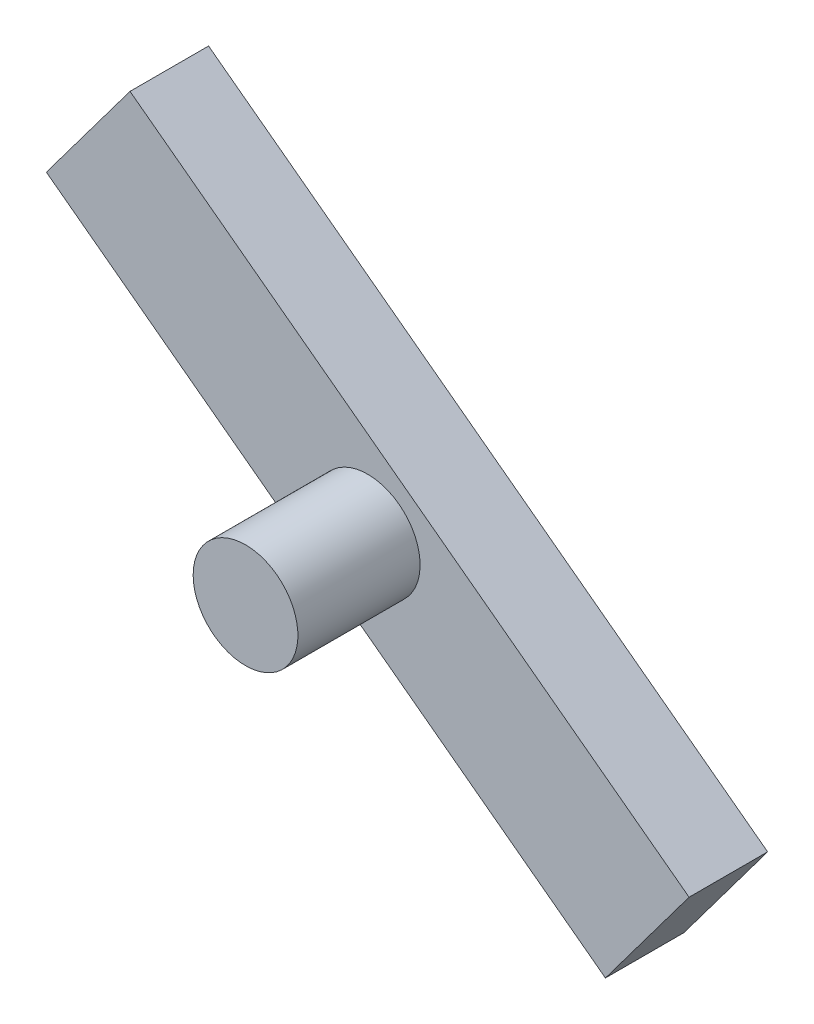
ISO-10303-21;
HEADER;
FILE_DESCRIPTION(('STEP AP214'),'2;1');
FILE_NAME('part.step','',(''),(''),'','','');
FILE_SCHEMA(('AUTOMOTIVE_DESIGN { 1 0 10303 214 1 1 1 1 }'));
ENDSEC;
DATA;
#1=APPLICATION_CONTEXT('core data for automotive mechanical design processes');
#2=APPLICATION_PROTOCOL_DEFINITION('international standard','automotive_design',2000,#1);
#3=PRODUCT_CONTEXT('',#1,'mechanical');
#4=PRODUCT('Part','Part','',(#3));
#5=PRODUCT_RELATED_PRODUCT_CATEGORY('part','',(#4));
#6=PRODUCT_DEFINITION_FORMATION('','',#4);
#7=PRODUCT_DEFINITION_CONTEXT('part definition',#1,'design');
#8=PRODUCT_DEFINITION('design','',#6,#7);
#9=PRODUCT_DEFINITION_SHAPE('','',#8);
#10=(LENGTH_UNIT() NAMED_UNIT(*) SI_UNIT(.MILLI.,.METRE.));
#11=(NAMED_UNIT(*) PLANE_ANGLE_UNIT() SI_UNIT($,.RADIAN.));
#12=(NAMED_UNIT(*) SI_UNIT($,.STERADIAN.) SOLID_ANGLE_UNIT());
#13=UNCERTAINTY_MEASURE_WITH_UNIT(LENGTH_MEASURE(1.E-05),#10,'distance_accuracy_value','');
#14=(GEOMETRIC_REPRESENTATION_CONTEXT(3) GLOBAL_UNCERTAINTY_ASSIGNED_CONTEXT((#13)) GLOBAL_UNIT_ASSIGNED_CONTEXT((#10,
#11,#12)) REPRESENTATION_CONTEXT('',''));
#15=CARTESIAN_POINT('',(0.,0.,0.));
#16=DIRECTION('',(0.,0.,1.));
#17=DIRECTION('',(1.,0.,0.));
#18=AXIS2_PLACEMENT_3D('',#15,#16,#17);
#19=CARTESIAN_POINT('',(-263.128358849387,316.504901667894,22.));
#20=DIRECTION('',(0.,0.,-1.));
#21=DIRECTION('',(-1.,0.,0.));
#22=AXIS2_PLACEMENT_3D('',#19,#20,#21);
#23=PLANE('',#22);
#24=CARTESIAN_POINT('',(-263.128358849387,316.504901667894,22.));
#25=DIRECTION('',(0.,0.,-1.));
#26=DIRECTION('',(-1.,0.,0.));
#27=AXIS2_PLACEMENT_3D('',#24,#25,#26);
#28=CIRCLE('',#27,3.);
#29=CARTESIAN_POINT('',(-266.128358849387,316.504901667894,22.));
#30=VERTEX_POINT('',#29);
#31=EDGE_CURVE('E48',#30,#30,#28,.T.);
#32=ORIENTED_EDGE('',*,*,#31,.F.);
#33=EDGE_LOOP('',(#32));
#34=FACE_BOUND('',#33,.T.);
#35=ADVANCED_FACE('F40',(#34),#23,.F.);
#36=CARTESIAN_POINT('',(-263.128358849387,316.504901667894,22.));
#37=DIRECTION('',(0.,0.,-1.));
#38=DIRECTION('',(-1.,0.,0.));
#39=AXIS2_PLACEMENT_3D('',#36,#37,#38);
#40=CYLINDRICAL_SURFACE('',#39,3.);
#41=CARTESIAN_POINT('',(-263.128358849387,316.504901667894,15.));
#42=DIRECTION('',(0.,0.,-1.));
#43=DIRECTION('',(-1.,0.,0.));
#44=AXIS2_PLACEMENT_3D('',#41,#42,#43);
#45=CIRCLE('',#44,3.);
#46=CARTESIAN_POINT('',(-266.128358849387,316.504901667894,15.));
#47=VERTEX_POINT('',#46);
#48=EDGE_CURVE('E12',#47,#47,#45,.T.);
#49=ORIENTED_EDGE('',*,*,#48,.F.);
#50=EDGE_LOOP('',(#49));
#51=FACE_BOUND('',#50,.T.);
#52=ORIENTED_EDGE('',*,*,#31,.T.);
#53=EDGE_LOOP('',(#52));
#54=FACE_BOUND('',#53,.T.);
#55=ADVANCED_FACE('F118',(#51,#54),#40,.T.);
#56=CARTESIAN_POINT('',(-281.537950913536,325.28481738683,15.));
#57=DIRECTION('',(0.599126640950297,0.800654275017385,0.));
#58=DIRECTION('',(-0.800654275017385,0.599126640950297,0.));
#59=AXIS2_PLACEMENT_3D('',#56,#57,#58);
#60=PLANE('',#59);
#61=DIRECTION('',(0.800654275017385,-0.599126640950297,0.));
#62=VECTOR('',#61,1.);
#63=CARTESIAN_POINT('',(-281.537950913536,325.28481738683,10.5));
#64=LINE('',#63,#62);
#65=CARTESIAN_POINT('',(-281.537950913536,325.28481738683,10.5));
#66=VERTEX_POINT('',#65);
#67=CARTESIAN_POINT('',(-249.51177991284,301.319751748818,10.5));
#68=VERTEX_POINT('',#67);
#69=EDGE_CURVE('E107',#66,#68,#64,.T.);
#70=ORIENTED_EDGE('',*,*,#69,.T.);
#71=DIRECTION('',(0.,0.,-1.));
#72=VECTOR('',#71,1.);
#73=CARTESIAN_POINT('',(-249.51177991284,301.319751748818,15.));
#74=LINE('',#73,#72);
#75=CARTESIAN_POINT('',(-249.51177991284,301.319751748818,15.));
#76=VERTEX_POINT('',#75);
#77=EDGE_CURVE('E98',#76,#68,#74,.T.);
#78=ORIENTED_EDGE('',*,*,#77,.F.);
#79=DIRECTION('',(0.800654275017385,-0.599126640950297,0.));
#80=VECTOR('',#79,1.);
#81=CARTESIAN_POINT('',(-281.537950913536,325.28481738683,15.));
#82=LINE('',#81,#80);
#83=CARTESIAN_POINT('',(-281.537950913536,325.28481738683,15.));
#84=VERTEX_POINT('',#83);
#85=EDGE_CURVE('E92',#84,#76,#82,.T.);
#86=ORIENTED_EDGE('',*,*,#85,.F.);
#87=DIRECTION('',(0.,0.,-1.));
#88=VECTOR('',#87,1.);
#89=CARTESIAN_POINT('',(-281.537950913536,325.28481738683,15.));
#90=LINE('',#89,#88);
#91=EDGE_CURVE('E103',#84,#66,#90,.T.);
#92=ORIENTED_EDGE('',*,*,#91,.T.);
#93=EDGE_LOOP('',(#70,#78,#86,#92));
#94=FACE_BOUND('',#93,.T.);
#95=ADVANCED_FACE('F121',(#94),#60,.F.);
#96=CARTESIAN_POINT('',(-249.51177991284,301.319751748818,15.));
#97=DIRECTION('',(-0.800654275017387,0.599126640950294,0.));
#98=DIRECTION('',(-0.599126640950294,-0.800654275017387,0.));
#99=AXIS2_PLACEMENT_3D('',#96,#97,#98);
#100=PLANE('',#99);
#101=DIRECTION('',(0.599126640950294,0.800654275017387,0.));
#102=VECTOR('',#101,1.);
#103=CARTESIAN_POINT('',(-249.51177991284,301.319751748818,10.5));
#104=LINE('',#103,#102);
#105=CARTESIAN_POINT('',(-244.718766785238,307.724985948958,10.5));
#106=VERTEX_POINT('',#105);
#107=EDGE_CURVE('E97',#68,#106,#104,.T.);
#108=ORIENTED_EDGE('',*,*,#107,.T.);
#109=DIRECTION('',(0.,0.,-1.));
#110=VECTOR('',#109,1.);
#111=CARTESIAN_POINT('',(-244.718766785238,307.724985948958,15.));
#112=LINE('',#111,#110);
#113=CARTESIAN_POINT('',(-244.718766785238,307.724985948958,15.));
#114=VERTEX_POINT('',#113);
#115=EDGE_CURVE('E95',#114,#106,#112,.T.);
#116=ORIENTED_EDGE('',*,*,#115,.F.);
#117=DIRECTION('',(0.599126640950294,0.800654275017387,0.));
#118=VECTOR('',#117,1.);
#119=CARTESIAN_POINT('',(-249.51177991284,301.319751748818,15.));
#120=LINE('',#119,#118);
#121=EDGE_CURVE('E87',#76,#114,#120,.T.);
#122=ORIENTED_EDGE('',*,*,#121,.F.);
#123=ORIENTED_EDGE('',*,*,#77,.T.);
#124=EDGE_LOOP('',(#108,#116,#122,#123));
#125=FACE_BOUND('',#124,.T.);
#126=ADVANCED_FACE('F96',(#125),#100,.F.);
#127=CARTESIAN_POINT('',(-244.718766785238,307.724985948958,15.));
#128=DIRECTION('',(-0.599126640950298,-0.800654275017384,0.));
#129=DIRECTION('',(0.800654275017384,-0.599126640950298,0.));
#130=AXIS2_PLACEMENT_3D('',#127,#128,#129);
#131=PLANE('',#130);
#132=DIRECTION('',(-0.800654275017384,0.599126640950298,0.));
#133=VECTOR('',#132,1.);
#134=CARTESIAN_POINT('',(-244.718766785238,307.724985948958,10.5));
#135=LINE('',#134,#133);
#136=CARTESIAN_POINT('',(-276.744937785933,331.690051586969,10.5));
#137=VERTEX_POINT('',#136);
#138=EDGE_CURVE('E73',#106,#137,#135,.T.);
#139=ORIENTED_EDGE('',*,*,#138,.T.);
#140=DIRECTION('',(0.,0.,-1.));
#141=VECTOR('',#140,1.);
#142=CARTESIAN_POINT('',(-276.744937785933,331.690051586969,15.));
#143=LINE('',#142,#141);
#144=CARTESIAN_POINT('',(-276.744937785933,331.690051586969,15.));
#145=VERTEX_POINT('',#144);
#146=EDGE_CURVE('E99',#145,#137,#143,.T.);
#147=ORIENTED_EDGE('',*,*,#146,.F.);
#148=DIRECTION('',(-0.800654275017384,0.599126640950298,0.));
#149=VECTOR('',#148,1.);
#150=CARTESIAN_POINT('',(-244.718766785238,307.724985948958,15.));
#151=LINE('',#150,#149);
#152=EDGE_CURVE('E90',#114,#145,#151,.T.);
#153=ORIENTED_EDGE('',*,*,#152,.F.);
#154=ORIENTED_EDGE('',*,*,#115,.T.);
#155=EDGE_LOOP('',(#139,#147,#153,#154));
#156=FACE_BOUND('',#155,.T.);
#157=ADVANCED_FACE('F101',(#156),#131,.F.);
#158=CARTESIAN_POINT('',(-276.744937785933,331.690051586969,15.));
#159=DIRECTION('',(0.800654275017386,-0.599126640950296,0.));
#160=DIRECTION('',(0.599126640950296,0.800654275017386,0.));
#161=AXIS2_PLACEMENT_3D('',#158,#159,#160);
#162=PLANE('',#161);
#163=DIRECTION('',(-0.599126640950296,-0.800654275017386,0.));
#164=VECTOR('',#163,1.);
#165=CARTESIAN_POINT('',(-276.744937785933,331.690051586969,10.5));
#166=LINE('',#165,#164);
#167=EDGE_CURVE('E79',#137,#66,#166,.T.);
#168=ORIENTED_EDGE('',*,*,#167,.T.);
#169=ORIENTED_EDGE('',*,*,#91,.F.);
#170=DIRECTION('',(-0.599126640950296,-0.800654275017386,0.));
#171=VECTOR('',#170,1.);
#172=CARTESIAN_POINT('',(-276.744937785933,331.690051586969,15.));
#173=LINE('',#172,#171);
#174=EDGE_CURVE('E56',#145,#84,#173,.T.);
#175=ORIENTED_EDGE('',*,*,#174,.F.);
#176=ORIENTED_EDGE('',*,*,#146,.T.);
#177=EDGE_LOOP('',(#168,#169,#175,#176));
#178=FACE_BOUND('',#177,.T.);
#179=ADVANCED_FACE('F136',(#178),#162,.F.);
#180=CARTESIAN_POINT('',(0.,0.,15.));
#181=DIRECTION('',(0.,0.,1.));
#182=DIRECTION('',(1.,0.,0.));
#183=AXIS2_PLACEMENT_3D('',#180,#181,#182);
#184=PLANE('',#183);
#185=ORIENTED_EDGE('',*,*,#48,.T.);
#186=EDGE_LOOP('',(#185));
#187=FACE_BOUND('',#186,.T.);
#188=ORIENTED_EDGE('',*,*,#85,.T.);
#189=ORIENTED_EDGE('',*,*,#121,.T.);
#190=ORIENTED_EDGE('',*,*,#152,.T.);
#191=ORIENTED_EDGE('',*,*,#174,.T.);
#192=EDGE_LOOP('',(#188,#189,#190,#191));
#193=FACE_BOUND('',#192,.T.);
#194=ADVANCED_FACE('F88',(#187,#193),#184,.T.);
#195=CARTESIAN_POINT('',(0.,0.,10.5));
#196=DIRECTION('',(0.,0.,1.));
#197=DIRECTION('',(1.,0.,0.));
#198=AXIS2_PLACEMENT_3D('',#195,#196,#197);
#199=PLANE('',#198);
#200=ORIENTED_EDGE('',*,*,#69,.F.);
#201=ORIENTED_EDGE('',*,*,#167,.F.);
#202=ORIENTED_EDGE('',*,*,#138,.F.);
#203=ORIENTED_EDGE('',*,*,#107,.F.);
#204=EDGE_LOOP('',(#200,#201,#202,#203));
#205=FACE_BOUND('',#204,.T.);
#206=ADVANCED_FACE('F139',(#205),#199,.F.);
#207=CLOSED_SHELL('',(#35,#55,#95,#126,#157,#179,#194,#206));
#208=MANIFOLD_SOLID_BREP('B2',#207);
#209=ADVANCED_BREP_SHAPE_REPRESENTATION('',(#18,#208),#14);
#210=SHAPE_DEFINITION_REPRESENTATION(#9,#209);
ENDSEC;
END-ISO-10303-21;
